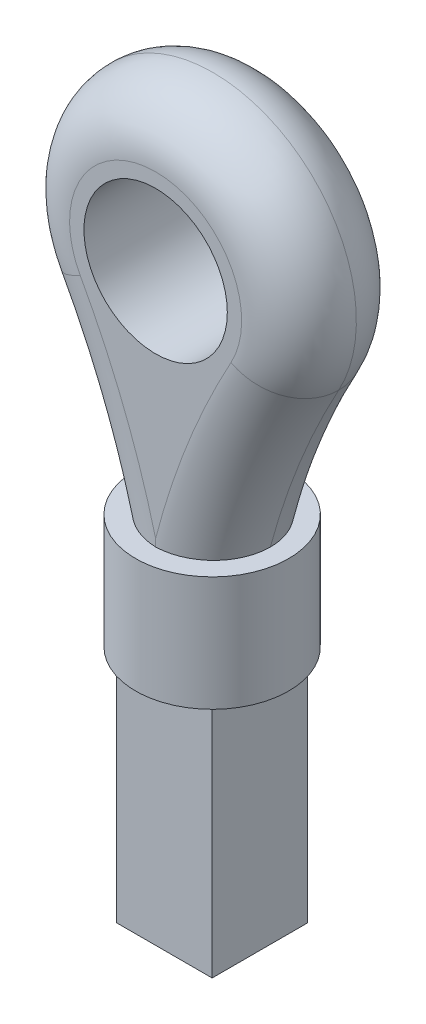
ISO-10303-21;
HEADER;
FILE_DESCRIPTION(('STEP AP214'),'2;1');
FILE_NAME('part.step','',(''),(''),'','','');
FILE_SCHEMA(('AUTOMOTIVE_DESIGN { 1 0 10303 214 1 1 1 1 }'));
ENDSEC;
DATA;
#1=APPLICATION_CONTEXT('core data for automotive mechanical design processes');
#2=APPLICATION_PROTOCOL_DEFINITION('international standard','automotive_design',2000,#1);
#3=PRODUCT_CONTEXT('',#1,'mechanical');
#4=PRODUCT('Part','Part','',(#3));
#5=PRODUCT_RELATED_PRODUCT_CATEGORY('part','',(#4));
#6=PRODUCT_DEFINITION_FORMATION('','',#4);
#7=PRODUCT_DEFINITION_CONTEXT('part definition',#1,'design');
#8=PRODUCT_DEFINITION('design','',#6,#7);
#9=PRODUCT_DEFINITION_SHAPE('','',#8);
#10=(LENGTH_UNIT() NAMED_UNIT(*) SI_UNIT(.MILLI.,.METRE.));
#11=(NAMED_UNIT(*) PLANE_ANGLE_UNIT() SI_UNIT($,.RADIAN.));
#12=(NAMED_UNIT(*) SI_UNIT($,.STERADIAN.) SOLID_ANGLE_UNIT());
#13=UNCERTAINTY_MEASURE_WITH_UNIT(LENGTH_MEASURE(1.E-05),#10,'distance_accuracy_value','');
#14=(GEOMETRIC_REPRESENTATION_CONTEXT(3) GLOBAL_UNCERTAINTY_ASSIGNED_CONTEXT((#13)) GLOBAL_UNIT_ASSIGNED_CONTEXT((#10,
#11,#12)) REPRESENTATION_CONTEXT('',''));
#15=CARTESIAN_POINT('',(0.,0.,0.));
#16=DIRECTION('',(0.,0.,1.));
#17=DIRECTION('',(1.,0.,0.));
#18=AXIS2_PLACEMENT_3D('',#15,#16,#17);
#19=CARTESIAN_POINT('',(0.,-37.,6.08685653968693));
#20=DIRECTION('',(0.,-1.,0.));
#21=DIRECTION('',(0.,0.,-1.));
#22=AXIS2_PLACEMENT_3D('',#19,#20,#21);
#23=PLANE('',#22);
#24=CARTESIAN_POINT('',(0.,-37.,6.08685653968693));
#25=DIRECTION('',(0.,-1.,0.));
#26=DIRECTION('',(0.,0.,-1.));
#27=AXIS2_PLACEMENT_3D('',#24,#25,#26);
#28=CIRCLE('',#27,8.00777729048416);
#29=CARTESIAN_POINT('',(0.,-37.,-1.92092075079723));
#30=VERTEX_POINT('',#29);
#31=EDGE_CURVE('E206',#30,#30,#28,.T.);
#32=ORIENTED_EDGE('',*,*,#31,.T.);
#33=EDGE_LOOP('',(#32));
#34=FACE_BOUND('',#33,.T.);
#35=DIRECTION('',(-1.,0.,0.));
#36=VECTOR('',#35,1.);
#37=CARTESIAN_POINT('',(-5.,-37.,11.0868565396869));
#38=LINE('',#37,#36);
#39=CARTESIAN_POINT('',(5.,-37.,11.0868565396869));
#40=VERTEX_POINT('',#39);
#41=CARTESIAN_POINT('',(-5.,-37.,11.0868565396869));
#42=VERTEX_POINT('',#41);
#43=EDGE_CURVE('E282',#40,#42,#38,.T.);
#44=ORIENTED_EDGE('',*,*,#43,.F.);
#45=DIRECTION('',(0.,0.,1.));
#46=VECTOR('',#45,1.);
#47=CARTESIAN_POINT('',(5.,-37.,11.0868565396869));
#48=LINE('',#47,#46);
#49=CARTESIAN_POINT('',(5.,-37.,1.08685653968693));
#50=VERTEX_POINT('',#49);
#51=EDGE_CURVE('E284',#50,#40,#48,.T.);
#52=ORIENTED_EDGE('',*,*,#51,.F.);
#53=DIRECTION('',(1.,0.,0.));
#54=VECTOR('',#53,1.);
#55=CARTESIAN_POINT('',(-5.,-37.,1.08685653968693));
#56=LINE('',#55,#54);
#57=CARTESIAN_POINT('',(-5.,-37.,1.08685653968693));
#58=VERTEX_POINT('',#57);
#59=EDGE_CURVE('E277',#58,#50,#56,.T.);
#60=ORIENTED_EDGE('',*,*,#59,.F.);
#61=DIRECTION('',(0.,0.,-1.));
#62=VECTOR('',#61,1.);
#63=CARTESIAN_POINT('',(-5.,-37.,11.0868565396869));
#64=LINE('',#63,#62);
#65=EDGE_CURVE('E280',#42,#58,#64,.T.);
#66=ORIENTED_EDGE('',*,*,#65,.F.);
#67=EDGE_LOOP('',(#44,#52,#60,#66));
#68=FACE_BOUND('',#67,.T.);
#69=ADVANCED_FACE('F37',(#34,#68),#23,.T.);
#70=CARTESIAN_POINT('',(-83.2658403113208,-45.736198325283,12.));
#71=DIRECTION('',(0.,0.,-1.));
#72=DIRECTION('',(-1.,0.,0.));
#73=AXIS2_PLACEMENT_3D('',#70,#71,#72);
#74=PLANE('',#73);
#75=CARTESIAN_POINT('',(0.,0.,12.));
#76=DIRECTION('',(0.,0.,-1.));
#77=DIRECTION('',(-1.,0.,0.));
#78=AXIS2_PLACEMENT_3D('',#75,#76,#77);
#79=CIRCLE('',#78,9.00000000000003);
#80=CARTESIAN_POINT('',(7.88834276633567,-4.33290299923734,12.));
#81=VERTEX_POINT('',#80);
#82=CARTESIAN_POINT('',(-7.88834276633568,-4.33290299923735,12.));
#83=VERTEX_POINT('',#82);
#84=EDGE_CURVE('E46',#81,#83,#79,.F.);
#85=ORIENTED_EDGE('',*,*,#84,.T.);
#86=CARTESIAN_POINT('',(-83.2658403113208,-45.736198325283,12.));
#87=DIRECTION('',(0.,0.,-1.));
#88=DIRECTION('',(-1.,0.,0.));
#89=AXIS2_PLACEMENT_3D('',#86,#87,#88);
#90=CIRCLE('',#89,86.);
#91=CARTESIAN_POINT('',(0.,-24.2234152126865,12.));
#92=VERTEX_POINT('',#91);
#93=EDGE_CURVE('E11',#83,#92,#90,.T.);
#94=ORIENTED_EDGE('',*,*,#93,.T.);
#95=CARTESIAN_POINT('',(83.2658403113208,-45.736198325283,12.));
#96=DIRECTION('',(0.,0.,-1.));
#97=DIRECTION('',(-1.,0.,0.));
#98=AXIS2_PLACEMENT_3D('',#95,#96,#97);
#99=CIRCLE('',#98,86.);
#100=EDGE_CURVE('E113',#92,#81,#99,.T.);
#101=ORIENTED_EDGE('',*,*,#100,.T.);
#102=EDGE_LOOP('',(#85,#94,#101));
#103=FACE_BOUND('',#102,.T.);
#104=CARTESIAN_POINT('',(0.,0.,12.));
#105=DIRECTION('',(0.,0.,1.));
#106=DIRECTION('',(1.,0.,0.));
#107=AXIS2_PLACEMENT_3D('',#104,#105,#106);
#108=CIRCLE('',#107,7.5);
#109=CARTESIAN_POINT('',(7.5,0.,12.));
#110=VERTEX_POINT('',#109);
#111=EDGE_CURVE('E124',#110,#110,#108,.T.);
#112=ORIENTED_EDGE('',*,*,#111,.F.);
#113=EDGE_LOOP('',(#112));
#114=FACE_BOUND('',#113,.T.);
#115=ADVANCED_FACE('F117',(#103,#114),#74,.F.);
#116=CARTESIAN_POINT('',(-83.2658403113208,-45.736198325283,0.));
#117=DIRECTION('',(0.,0.,-1.));
#118=DIRECTION('',(-1.,0.,0.));
#119=AXIS2_PLACEMENT_3D('',#116,#117,#118);
#120=PLANE('',#119);
#121=CARTESIAN_POINT('',(83.2658403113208,-45.736198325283,0.));
#122=DIRECTION('',(0.,0.,-1.));
#123=DIRECTION('',(-1.,0.,0.));
#124=AXIS2_PLACEMENT_3D('',#121,#122,#123);
#125=CIRCLE('',#124,86.);
#126=CARTESIAN_POINT('',(7.88834276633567,-4.33290299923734,0.));
#127=VERTEX_POINT('',#126);
#128=CARTESIAN_POINT('',(0.,-24.2234152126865,0.));
#129=VERTEX_POINT('',#128);
#130=EDGE_CURVE('E195',#127,#129,#125,.F.);
#131=ORIENTED_EDGE('',*,*,#130,.T.);
#132=CARTESIAN_POINT('',(-83.2658403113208,-45.736198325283,0.));
#133=DIRECTION('',(0.,0.,-1.));
#134=DIRECTION('',(-1.,0.,0.));
#135=AXIS2_PLACEMENT_3D('',#132,#133,#134);
#136=CIRCLE('',#135,86.);
#137=CARTESIAN_POINT('',(-7.88834276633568,-4.33290299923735,0.));
#138=VERTEX_POINT('',#137);
#139=EDGE_CURVE('E115',#129,#138,#136,.F.);
#140=ORIENTED_EDGE('',*,*,#139,.T.);
#141=CARTESIAN_POINT('',(0.,0.,0.));
#142=DIRECTION('',(0.,0.,-1.));
#143=DIRECTION('',(-1.,0.,0.));
#144=AXIS2_PLACEMENT_3D('',#141,#142,#143);
#145=CIRCLE('',#144,9.00000000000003);
#146=EDGE_CURVE('E249',#138,#127,#145,.T.);
#147=ORIENTED_EDGE('',*,*,#146,.T.);
#148=EDGE_LOOP('',(#131,#140,#147));
#149=FACE_BOUND('',#148,.T.);
#150=CARTESIAN_POINT('',(0.,0.,0.));
#151=DIRECTION('',(0.,0.,1.));
#152=DIRECTION('',(1.,0.,0.));
#153=AXIS2_PLACEMENT_3D('',#150,#151,#152);
#154=CIRCLE('',#153,7.5);
#155=CARTESIAN_POINT('',(7.5,0.,0.));
#156=VERTEX_POINT('',#155);
#157=EDGE_CURVE('E126',#156,#156,#154,.T.);
#158=ORIENTED_EDGE('',*,*,#157,.T.);
#159=EDGE_LOOP('',(#158));
#160=FACE_BOUND('',#159,.T.);
#161=ADVANCED_FACE('F120',(#149,#160),#120,.T.);
#162=CARTESIAN_POINT('',(0.,0.,12.));
#163=DIRECTION('',(0.,0.,-1.));
#164=DIRECTION('',(-1.,0.,0.));
#165=AXIS2_PLACEMENT_3D('',#162,#163,#164);
#166=CYLINDRICAL_SURFACE('',#165,7.5);
#167=ORIENTED_EDGE('',*,*,#111,.T.);
#168=EDGE_LOOP('',(#167));
#169=FACE_BOUND('',#168,.T.);
#170=ORIENTED_EDGE('',*,*,#157,.F.);
#171=EDGE_LOOP('',(#170));
#172=FACE_BOUND('',#171,.T.);
#173=ADVANCED_FACE('F235',(#169,#172),#166,.F.);
#174=CARTESIAN_POINT('',(0.,0.,6.));
#175=DIRECTION('',(0.,0.,-1.));
#176=DIRECTION('',(-1.,0.,0.));
#177=AXIS2_PLACEMENT_3D('',#174,#175,#176);
#178=TOROIDAL_SURFACE('',#177,9.00000000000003,6.);
#179=CARTESIAN_POINT('',(-7.88834276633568,-4.33290299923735,6.));
#180=DIRECTION('',(0.481433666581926,-0.876482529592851,0.));
#181=DIRECTION('',(0.876482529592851,0.481433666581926,0.));
#182=AXIS2_PLACEMENT_3D('',#179,#180,#181);
#183=CIRCLE('',#182,6.);
#184=CARTESIAN_POINT('',(-13.1472379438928,-7.2215049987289,6.));
#185=VERTEX_POINT('',#184);
#186=EDGE_CURVE('E110',#83,#185,#183,.T.);
#187=ORIENTED_EDGE('',*,*,#186,.F.);
#188=ORIENTED_EDGE('',*,*,#84,.F.);
#189=CARTESIAN_POINT('',(7.88834276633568,-4.33290299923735,6.));
#190=DIRECTION('',(-0.481433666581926,-0.876482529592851,0.));
#191=DIRECTION('',(0.876482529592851,-0.481433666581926,0.));
#192=AXIS2_PLACEMENT_3D('',#189,#190,#191);
#193=CIRCLE('',#192,6.);
#194=CARTESIAN_POINT('',(13.1472379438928,-7.2215049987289,6.));
#195=VERTEX_POINT('',#194);
#196=EDGE_CURVE('E41',#195,#81,#193,.T.);
#197=ORIENTED_EDGE('',*,*,#196,.F.);
#198=CARTESIAN_POINT('',(0.,0.,6.));
#199=DIRECTION('',(0.,0.,-1.));
#200=DIRECTION('',(-1.,0.,0.));
#201=AXIS2_PLACEMENT_3D('',#198,#199,#200);
#202=CIRCLE('',#201,15.);
#203=EDGE_CURVE('E181',#185,#195,#202,.T.);
#204=ORIENTED_EDGE('',*,*,#203,.F.);
#205=EDGE_LOOP('',(#187,#188,#197,#204));
#206=FACE_BOUND('',#205,.T.);
#207=ADVANCED_FACE('F39',(#206),#178,.T.);
#208=CARTESIAN_POINT('',(83.2658403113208,-45.736198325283,6.));
#209=DIRECTION('',(0.,0.,-1.));
#210=DIRECTION('',(-1.,0.,0.));
#211=AXIS2_PLACEMENT_3D('',#208,#209,#210);
#212=TOROIDAL_SURFACE('',#211,86.,6.);
#213=ORIENTED_EDGE('',*,*,#196,.T.);
#214=ORIENTED_EDGE('',*,*,#100,.F.);
#215=CARTESIAN_POINT('',(0.,-24.2234152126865,12.));
#216=CARTESIAN_POINT('',(0.,-24.2234152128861,12.));
#217=CARTESIAN_POINT('',(0.,-24.2234152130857,12.));
#218=CARTESIAN_POINT('',(0.,-24.2308349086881,12.));
#219=CARTESIAN_POINT('',(0.,-24.2382546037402,11.9999991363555));
#220=CARTESIAN_POINT('',(0.,-25.2460721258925,11.9997658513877));
#221=CARTESIAN_POINT('',(0.,-26.2464799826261,11.9840123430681));
#222=CARTESIAN_POINT('',(0.,-28.2467892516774,11.9326222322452));
#223=CARTESIAN_POINT('',(0.,-29.2466905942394,11.8969833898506));
#224=CARTESIAN_POINT('',(0.,-31.2464519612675,11.8154396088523));
#225=CARTESIAN_POINT('',(0.,-32.2463118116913,11.769530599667));
#226=CARTESIAN_POINT('',(0.,-34.245927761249,11.6761034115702));
#227=CARTESIAN_POINT('',(0.,-35.2456838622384,11.6285852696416));
#228=CARTESIAN_POINT('',(0.,-36.8900450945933,11.5553754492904));
#229=CARTESIAN_POINT('',(0.,-37.5345694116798,11.5279293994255));
#230=CARTESIAN_POINT('',(0.,-38.8237868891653,11.4772788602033));
#231=CARTESIAN_POINT('',(0.,-39.4684800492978,11.4540743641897));
#232=CARTESIAN_POINT('',(0.,-40.7580264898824,11.4133879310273));
#233=CARTESIAN_POINT('',(0.,-41.4028797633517,11.3959057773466));
#234=CARTESIAN_POINT('',(0.,-42.6927376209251,11.3677738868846));
#235=CARTESIAN_POINT('',(0.,-43.33774220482,11.357124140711));
#236=CARTESIAN_POINT('',(0.,-44.6276776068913,11.3433397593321));
#237=CARTESIAN_POINT('',(0.,-45.2726084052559,11.3402033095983));
#238=CARTESIAN_POINT('',(0.,-46.5624613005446,11.3416411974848));
#239=CARTESIAN_POINT('',(0.,-47.2073833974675,11.3462155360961));
#240=CARTESIAN_POINT('',(0.,-48.4971371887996,11.3627819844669));
#241=CARTESIAN_POINT('',(0.,-49.141968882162,11.3747741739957));
#242=CARTESIAN_POINT('',(0.,-50.431471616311,11.4054108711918));
#243=CARTESIAN_POINT('',(0.,-51.0761426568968,11.4240553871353));
#244=CARTESIAN_POINT('',(0.,-52.3669663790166,11.4668671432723));
#245=CARTESIAN_POINT('',(0.,-53.0131185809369,11.4910485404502));
#246=CARTESIAN_POINT('',(0.,-54.3052610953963,11.5433609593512));
#247=CARTESIAN_POINT('',(0.,-54.9512514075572,11.5714919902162));
#248=CARTESIAN_POINT('',(0.,-56.2431928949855,11.6298803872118));
#249=CARTESIAN_POINT('',(0.,-56.889144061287,11.6601379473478));
#250=CARTESIAN_POINT('',(0.,-58.1810471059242,11.7207321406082));
#251=CARTESIAN_POINT('',(0.,-58.826998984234,11.7510687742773));
#252=CARTESIAN_POINT('',(0.,-60.1188569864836,11.8095897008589));
#253=CARTESIAN_POINT('',(0.,-60.7647630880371,11.8377744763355));
#254=CARTESIAN_POINT('',(0.,-62.056754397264,11.8896100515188));
#255=CARTESIAN_POINT('',(0.,-62.7028396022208,11.9132609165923));
#256=CARTESIAN_POINT('',(0.,-63.9951390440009,11.9534561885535));
#257=CARTESIAN_POINT('',(0.,-64.6413532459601,11.9700016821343));
#258=CARTESIAN_POINT('',(0.,-65.933954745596,11.9931972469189));
#259=CARTESIAN_POINT('',(0.,-66.5803420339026,11.9998477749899));
#260=CARTESIAN_POINT('',(0.,-67.2341420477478,11.9999991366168));
#261=CARTESIAN_POINT('',(0.,-67.2415617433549,11.9999999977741));
#262=CARTESIAN_POINT('',(0.,-67.2489814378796,12.));
#263=B_SPLINE_CURVE_WITH_KNOTS('',3,(#215,#216,#217,#218,#219,#220,#221,#222,#223,#224,#225,
#226,#227,#228,#229,#230,#231,#232,#233,#234,#235,#236,#237,#238,#239,#240,#241,#242,#243,#244,
#245,#246,#247,#248,#249,#250,#251,#252,#253,#254,#255,#256,#257,#258,#259,#260,#261,#262),
.UNSPECIFIED.,.F.,.F.,(4,2,2,2,2,2,2,2,2,2,2,2,2,2,2,2,2,2,2,2,2,2,2,4),(0.,
5.98895932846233E-10,0.0222590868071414,3.023452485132,6.02498400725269,9.027707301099,
12.0303616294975,13.9656773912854,15.9009901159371,17.8362296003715,19.7714664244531,
21.7062358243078,23.6410054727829,25.5757959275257,27.5105887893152,29.4503849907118,
31.3901856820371,33.3301635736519,35.2701548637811,37.2097098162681,39.1492368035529,
41.0884670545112,43.0276077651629,43.0498668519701),.UNSPECIFIED.);
#264=CARTESIAN_POINT('',(0.,-25.,11.996960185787));
#265=VERTEX_POINT('',#264);
#266=EDGE_CURVE('E104',#265,#92,#263,.F.);
#267=ORIENTED_EDGE('',*,*,#266,.F.);
#268=CARTESIAN_POINT('',(6.,-25.,6.));
#269=CARTESIAN_POINT('',(6.00002201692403,-25.,6.16466926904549));
#270=CARTESIAN_POINT('',(5.99298208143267,-25.,6.32933364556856));
#271=CARTESIAN_POINT('',(5.96493877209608,-25.,6.65744971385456));
#272=CARTESIAN_POINT('',(5.94393709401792,-25.,6.82090155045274));
#273=CARTESIAN_POINT('',(5.88817783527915,-25.,7.14515606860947));
#274=CARTESIAN_POINT('',(5.85344355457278,-25.,7.3059627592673));
#275=CARTESIAN_POINT('',(5.77052586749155,-25.,7.62406897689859));
#276=CARTESIAN_POINT('',(5.72234243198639,-25.,7.78136849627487));
#277=CARTESIAN_POINT('',(5.61293958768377,-25.,8.09134799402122));
#278=CARTESIAN_POINT('',(5.55172140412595,-25.,8.24402840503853));
#279=CARTESIAN_POINT('',(5.41673123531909,-25.,8.54379993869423));
#280=CARTESIAN_POINT('',(5.34295461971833,-25.,8.69088897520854));
#281=CARTESIAN_POINT('',(5.18348635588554,-25.,8.97839679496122));
#282=CARTESIAN_POINT('',(5.09779841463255,-25.,9.11881763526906));
#283=CARTESIAN_POINT('',(4.91513116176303,-25.,9.39218431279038));
#284=CARTESIAN_POINT('',(4.81814762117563,-25.,9.52512732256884));
#285=CARTESIAN_POINT('',(4.61212353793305,-25.,9.78458041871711));
#286=CARTESIAN_POINT('',(4.50292427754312,-25.,9.91096445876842));
#287=CARTESIAN_POINT('',(4.27447282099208,-25.,10.1543760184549));
#288=CARTESIAN_POINT('',(4.15521695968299,-25.,10.2714000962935));
#289=CARTESIAN_POINT('',(3.90758270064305,-25.,10.495319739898));
#290=CARTESIAN_POINT('',(3.77920562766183,-25.,10.6022167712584));
#291=CARTESIAN_POINT('',(3.51418079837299,-25.,10.8053144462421));
#292=CARTESIAN_POINT('',(3.37752996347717,-25.,10.9015110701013));
#293=CARTESIAN_POINT('',(3.09250680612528,-25.,11.0854802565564));
#294=CARTESIAN_POINT('',(2.94390052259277,-25.,11.1728904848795));
#295=CARTESIAN_POINT('',(2.63994737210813,-25.,11.3352089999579));
#296=CARTESIAN_POINT('',(2.48459815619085,-25.,11.410112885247));
#297=CARTESIAN_POINT('',(2.16830589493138,-25.,11.5469416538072));
#298=CARTESIAN_POINT('',(2.00736343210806,-25.,11.6088678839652));
#299=CARTESIAN_POINT('',(1.6809659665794,-25.,11.7193974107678));
#300=CARTESIAN_POINT('',(1.51551086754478,-25.,11.7680004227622));
#301=CARTESIAN_POINT('',(1.17656427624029,-25.,11.8527632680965));
#302=CARTESIAN_POINT('',(1.00297713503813,-25.,11.8885410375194));
#303=CARTESIAN_POINT('',(0.65348358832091,-25.,11.9455011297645));
#304=CARTESIAN_POINT('',(0.477577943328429,-25.,11.9666881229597));
#305=CARTESIAN_POINT('',(0.124532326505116,-25.,11.9943560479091));
#306=CARTESIAN_POINT('',(-0.0526081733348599,-25.,12.0008302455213));
#307=CARTESIAN_POINT('',(-0.406747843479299,-25.,11.998999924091));
#308=CARTESIAN_POINT('',(-0.583747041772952,-25.,11.9907008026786));
#309=CARTESIAN_POINT('',(-0.938504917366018,-25.,11.9591813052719));
#310=CARTESIAN_POINT('',(-1.11624820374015,-25.,11.9357872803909));
#311=CARTESIAN_POINT('',(-1.46905147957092,-25.,11.8740475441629));
#312=CARTESIAN_POINT('',(-1.64411244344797,-25.,11.8357074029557));
#313=CARTESIAN_POINT('',(-1.99039993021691,-25.,11.7442756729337));
#314=CARTESIAN_POINT('',(-2.16162522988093,-25.,11.6911794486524));
#315=CARTESIAN_POINT('',(-2.49884958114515,-25.,11.5705764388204));
#316=CARTESIAN_POINT('',(-2.6648506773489,-25.,11.5030753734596));
#317=CARTESIAN_POINT('',(-2.98909133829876,-25.,11.3546820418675));
#318=CARTESIAN_POINT('',(-3.14738388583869,-25.,11.2739055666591));
#319=CARTESIAN_POINT('',(-3.45640591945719,-25.,11.099110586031));
#320=CARTESIAN_POINT('',(-3.60713822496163,-25.,11.0050970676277));
#321=CARTESIAN_POINT('',(-3.90000517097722,-25.,10.8043618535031));
#322=CARTESIAN_POINT('',(-4.04213540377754,-25.,10.697633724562));
#323=CARTESIAN_POINT('',(-4.31657391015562,-25.,10.4722270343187));
#324=CARTESIAN_POINT('',(-4.44888271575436,-25.,10.3535491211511));
#325=CARTESIAN_POINT('',(-4.69976598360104,-25.,10.1078402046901));
#326=CARTESIAN_POINT('',(-4.81858120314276,-25.,9.98105497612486));
#327=CARTESIAN_POINT('',(-5.04483742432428,-25.,9.71771694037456));
#328=CARTESIAN_POINT('',(-5.15227904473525,-25.,9.5811646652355));
#329=CARTESIAN_POINT('',(-5.35474195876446,-25.,9.29948815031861));
#330=CARTESIAN_POINT('',(-5.44978334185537,-25.,9.15437834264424));
#331=CARTESIAN_POINT('',(-5.62681741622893,-25.,8.85648941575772));
#332=CARTESIAN_POINT('',(-5.70881752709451,-25.,8.70371472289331));
#333=CARTESIAN_POINT('',(-5.82392169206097,-25.,8.46468554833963));
#334=CARTESIAN_POINT('',(-5.86194672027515,-25.,8.38076748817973));
#335=CARTESIAN_POINT('',(-5.93398209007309,-25.,8.21137059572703));
#336=CARTESIAN_POINT('',(-5.96799822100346,-25.,8.12589422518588));
#337=CARTESIAN_POINT('',(-6.00000000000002,-25.,8.03965713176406));
#338=B_SPLINE_CURVE_WITH_KNOTS('',3,(#268,#269,#270,#271,#272,#273,#274,#275,#276,#277,#278,
#279,#280,#281,#282,#283,#284,#285,#286,#287,#288,#289,#290,#291,#292,#293,#294,#295,#296,#297,
#298,#299,#300,#301,#302,#303,#304,#305,#306,#307,#308,#309,#310,#311,#312,#313,#314,#315,#316,
#317,#318,#319,#320,#321,#322,#323,#324,#325,#326,#327,#328,#329,#330,#331,#332,#333,#334,#335,
#336,#337),.UNSPECIFIED.,.F.,.F.,(4,2,2,2,2,2,2,2,2,2,2,2,2,2,2,2,2,2,2,2,2,2,2,2,2,2,2,2,2,2,2,
2,2,2,4),(0.,0.49385005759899,0.987640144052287,1.48059599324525,1.97355291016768,
2.46646351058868,2.95955624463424,3.45249586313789,3.9456206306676,4.44612524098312,
4.94681305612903,5.44742830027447,5.94823097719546,6.46486163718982,6.9816737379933,
7.49843217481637,8.01520165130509,8.54628889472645,9.07720606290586,9.60836618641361,
10.1393322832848,10.6765181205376,11.2135039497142,11.7506586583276,12.28760045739,
12.8200858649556,13.3523711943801,13.8849269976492,14.4174539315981,14.9380866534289,
15.4586910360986,15.978441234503,16.4978946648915,16.7741993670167,17.0501000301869),.UNSPECIFIED.);
#339=CARTESIAN_POINT('',(6.,-25.,6.));
#340=VERTEX_POINT('',#339);
#341=EDGE_CURVE('E83',#340,#265,#338,.T.);
#342=ORIENTED_EDGE('',*,*,#341,.F.);
#343=CARTESIAN_POINT('',(83.2658403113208,-45.736198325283,6.));
#344=DIRECTION('',(0.,0.,-1.));
#345=DIRECTION('',(-1.,0.,0.));
#346=AXIS2_PLACEMENT_3D('',#343,#344,#345);
#347=CIRCLE('',#346,80.);
#348=EDGE_CURVE('E111',#195,#340,#347,.F.);
#349=ORIENTED_EDGE('',*,*,#348,.F.);
#350=EDGE_LOOP('',(#213,#214,#267,#342,#349));
#351=FACE_BOUND('',#350,.T.);
#352=ADVANCED_FACE('F114',(#351),#212,.T.);
#353=CARTESIAN_POINT('',(0.,0.,6.));
#354=DIRECTION('',(0.,0.,-1.));
#355=DIRECTION('',(-1.,0.,0.));
#356=AXIS2_PLACEMENT_3D('',#353,#354,#355);
#357=TOROIDAL_SURFACE('',#356,9.00000000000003,6.);
#358=CARTESIAN_POINT('',(-7.88834276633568,-4.33290299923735,6.));
#359=DIRECTION('',(0.481433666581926,-0.876482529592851,0.));
#360=DIRECTION('',(0.876482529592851,0.481433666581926,0.));
#361=AXIS2_PLACEMENT_3D('',#358,#359,#360);
#362=CIRCLE('',#361,6.);
#363=EDGE_CURVE('E189',#185,#138,#362,.T.);
#364=ORIENTED_EDGE('',*,*,#363,.F.);
#365=ORIENTED_EDGE('',*,*,#203,.T.);
#366=CARTESIAN_POINT('',(7.88834276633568,-4.33290299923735,6.));
#367=DIRECTION('',(-0.481433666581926,-0.876482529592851,0.));
#368=DIRECTION('',(0.876482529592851,-0.481433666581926,0.));
#369=AXIS2_PLACEMENT_3D('',#366,#367,#368);
#370=CIRCLE('',#369,6.);
#371=EDGE_CURVE('E187',#127,#195,#370,.T.);
#372=ORIENTED_EDGE('',*,*,#371,.F.);
#373=ORIENTED_EDGE('',*,*,#146,.F.);
#374=EDGE_LOOP('',(#364,#365,#372,#373));
#375=FACE_BOUND('',#374,.T.);
#376=ADVANCED_FACE('F172',(#375),#357,.T.);
#377=CARTESIAN_POINT('',(-83.2658403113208,-45.736198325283,6.));
#378=DIRECTION('',(0.,0.,-1.));
#379=DIRECTION('',(-1.,0.,0.));
#380=AXIS2_PLACEMENT_3D('',#377,#378,#379);
#381=TOROIDAL_SURFACE('',#380,86.,6.);
#382=ORIENTED_EDGE('',*,*,#93,.F.);
#383=ORIENTED_EDGE('',*,*,#186,.T.);
#384=CARTESIAN_POINT('',(-83.2658403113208,-45.736198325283,6.));
#385=DIRECTION('',(0.,0.,-1.));
#386=DIRECTION('',(-1.,0.,0.));
#387=AXIS2_PLACEMENT_3D('',#384,#385,#386);
#388=CIRCLE('',#387,80.);
#389=CARTESIAN_POINT('',(-6.,-25.,6.));
#390=VERTEX_POINT('',#389);
#391=EDGE_CURVE('E196',#390,#185,#388,.F.);
#392=ORIENTED_EDGE('',*,*,#391,.F.);
#393=CARTESIAN_POINT('',(6.,-25.,8.03965713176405));
#394=CARTESIAN_POINT('',(5.94130359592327,-25.,8.19788701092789));
#395=CARTESIAN_POINT('',(5.87578062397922,-25.,8.35357353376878));
#396=CARTESIAN_POINT('',(5.73171088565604,-25.,8.65876945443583));
#397=CARTESIAN_POINT('',(5.65316626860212,-25.,8.80827986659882));
#398=CARTESIAN_POINT('',(5.48380860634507,-25.,9.09983505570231));
#399=CARTESIAN_POINT('',(5.39301689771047,-25.,9.24189223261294));
#400=CARTESIAN_POINT('',(5.1997858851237,-25.,9.51785134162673));
#401=CARTESIAN_POINT('',(5.09734638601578,-25.,9.65175313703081));
#402=CARTESIAN_POINT('',(4.8816482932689,-25.,9.91046578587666));
#403=CARTESIAN_POINT('',(4.7683930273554,-25.,10.0352794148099));
#404=CARTESIAN_POINT('',(4.53185297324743,-25.,10.2750976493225));
#405=CARTESIAN_POINT('',(4.40856450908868,-25.,10.390098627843));
#406=CARTESIAN_POINT('',(4.15294032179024,-25.,10.6094898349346));
#407=CARTESIAN_POINT('',(4.02060689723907,-25.,10.7138827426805));
#408=CARTESIAN_POINT('',(3.74777164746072,-25.,10.9114927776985));
#409=CARTESIAN_POINT('',(3.60726677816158,-25.,11.0047057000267));
#410=CARTESIAN_POINT('',(3.31652680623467,-25.,11.180936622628));
#411=CARTESIAN_POINT('',(3.16616198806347,-25.,11.2637406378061));
#412=CARTESIAN_POINT('',(2.85906065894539,-25.,11.4166895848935));
#413=CARTESIAN_POINT('',(2.70232182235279,-25.,11.4868298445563));
#414=CARTESIAN_POINT('',(2.38364792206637,-25.,11.614003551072));
#415=CARTESIAN_POINT('',(2.22171377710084,-25.,11.6710393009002));
#416=CARTESIAN_POINT('',(1.89367311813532,-25.,11.7717250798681));
#417=CARTESIAN_POINT('',(1.72756507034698,-25.,11.8153701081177));
#418=CARTESIAN_POINT('',(1.38810942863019,-25.,11.8899473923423));
#419=CARTESIAN_POINT('',(1.21468499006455,-25.,11.9205301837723));
#420=CARTESIAN_POINT('',(0.865836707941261,-25.,11.96719850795));
#421=CARTESIAN_POINT('',(0.690412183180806,-25.,11.9832789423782));
#422=CARTESIAN_POINT('',(0.33885543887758,-25.,12.0008481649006));
#423=CARTESIAN_POINT('',(0.162723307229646,-25.,12.0023387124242));
#424=CARTESIAN_POINT('',(-0.189060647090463,-25.,11.9907405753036));
#425=CARTESIAN_POINT('',(-0.364712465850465,-25.,11.9776517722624));
#426=CARTESIAN_POINT('',(-0.717146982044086,-25.,11.9366560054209));
#427=CARTESIAN_POINT('',(-0.893902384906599,-25.,11.9085139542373));
#428=CARTESIAN_POINT('',(-1.24435624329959,-25.,11.8374599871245));
#429=CARTESIAN_POINT('',(-1.41805572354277,-25.,11.794553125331));
#430=CARTESIAN_POINT('',(-1.76128919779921,-25.,11.6942109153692));
#431=CARTESIAN_POINT('',(-1.93082137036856,-25.,11.6367693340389));
#432=CARTESIAN_POINT('',(-2.26434302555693,-25.,11.5077450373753));
#433=CARTESIAN_POINT('',(-2.428334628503,-25.,11.4361678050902));
#434=CARTESIAN_POINT('',(-2.74934204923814,-25.,11.27944015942));
#435=CARTESIAN_POINT('',(-2.90636967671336,-25.,11.19431394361));
#436=CARTESIAN_POINT('',(-3.21250459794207,-25.,11.0109684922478));
#437=CARTESIAN_POINT('',(-3.36161500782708,-25.,10.9127544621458));
#438=CARTESIAN_POINT('',(-3.65085569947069,-25.,10.7038111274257));
#439=CARTESIAN_POINT('',(-3.79098365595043,-25.,10.5930786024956));
#440=CARTESIAN_POINT('',(-4.06103167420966,-25.,10.3598983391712));
#441=CARTESIAN_POINT('',(-4.19095597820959,-25.,10.2374555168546));
#442=CARTESIAN_POINT('',(-4.4368766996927,-25.,9.9844311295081));
#443=CARTESIAN_POINT('',(-4.5531141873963,-25.,9.85408385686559));
#444=CARTESIAN_POINT('',(-4.77384006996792,-25.,9.58387462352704));
#445=CARTESIAN_POINT('',(-4.87833309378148,-25.,9.44401644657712));
#446=CARTESIAN_POINT('',(-5.07477504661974,-25.,9.1556495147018));
#447=CARTESIAN_POINT('',(-5.16671791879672,-25.,9.00713663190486));
#448=CARTESIAN_POINT('',(-5.33718148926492,-25.,8.70260406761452));
#449=CARTESIAN_POINT('',(-5.41570303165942,-25.,8.54658485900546));
#450=CARTESIAN_POINT('',(-5.55632825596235,-25.,8.23329186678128));
#451=CARTESIAN_POINT('',(-5.61887632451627,-25.,8.07621742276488));
#452=CARTESIAN_POINT('',(-5.7301768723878,-25.,7.75725854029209));
#453=CARTESIAN_POINT('',(-5.77893014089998,-25.,7.59537437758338));
#454=CARTESIAN_POINT('',(-5.86213261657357,-25.,7.26828158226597));
#455=CARTESIAN_POINT('',(-5.89660694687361,-25.,7.10307932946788));
#456=CARTESIAN_POINT('',(-5.95104607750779,-25.,6.77037478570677));
#457=CARTESIAN_POINT('',(-5.971019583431,-25.,6.60287393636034));
#458=CARTESIAN_POINT('',(-5.98910925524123,-25.,6.36247504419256));
#459=CARTESIAN_POINT('',(-5.99319554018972,-25.,6.28998540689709));
#460=CARTESIAN_POINT('',(-5.99863895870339,-25.,6.14500016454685));
#461=CARTESIAN_POINT('',(-5.99999971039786,-25.,6.07250469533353));
#462=CARTESIAN_POINT('',(-6.00000000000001,-25.,6.));
#463=B_SPLINE_CURVE_WITH_KNOTS('',3,(#393,#394,#395,#396,#397,#398,#399,#400,#401,#402,#403,
#404,#405,#406,#407,#408,#409,#410,#411,#412,#413,#414,#415,#416,#417,#418,#419,#420,#421,#422,
#423,#424,#425,#426,#427,#428,#429,#430,#431,#432,#433,#434,#435,#436,#437,#438,#439,#440,#441,
#442,#443,#444,#445,#446,#447,#448,#449,#450,#451,#452,#453,#454,#455,#456,#457,#458,#459,#460,
#461,#462),.UNSPECIFIED.,.F.,.F.,(4,2,2,2,2,2,2,2,2,2,2,2,2,2,2,2,2,2,2,2,2,2,2,2,2,2,2,2,2,2,2,
2,2,2,4),(0.,0.506127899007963,1.01217234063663,1.51734628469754,2.02252869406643,
2.52755616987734,3.0327695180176,3.53785495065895,4.0431297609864,4.55750978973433,
5.07207921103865,5.58655813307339,6.10122895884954,6.62891732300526,7.15679112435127,
7.68460126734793,8.21241569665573,8.74872455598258,9.28485001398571,9.82120577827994,
10.3573539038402,10.8925550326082,11.4275439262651,11.9626707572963,12.4975739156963,
13.0208686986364,13.5439565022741,14.0672958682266,14.590602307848,15.0971895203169,
15.603747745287,16.1094108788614,16.6147701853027,16.8325423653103,17.0500252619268),.UNSPECIFIED.);
#464=EDGE_CURVE('E109',#265,#390,#463,.T.);
#465=ORIENTED_EDGE('',*,*,#464,.F.);
#466=ORIENTED_EDGE('',*,*,#266,.T.);
#467=EDGE_LOOP('',(#382,#383,#392,#465,#466));
#468=FACE_BOUND('',#467,.T.);
#469=ADVANCED_FACE('F106',(#468),#381,.T.);
#470=CARTESIAN_POINT('',(83.2658403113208,-45.736198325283,6.));
#471=DIRECTION('',(0.,0.,-1.));
#472=DIRECTION('',(-1.,0.,0.));
#473=AXIS2_PLACEMENT_3D('',#470,#471,#472);
#474=TOROIDAL_SURFACE('',#473,86.,6.);
#475=ORIENTED_EDGE('',*,*,#348,.T.);
#476=CARTESIAN_POINT('',(-6.,-25.,3.96034286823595));
#477=CARTESIAN_POINT('',(-5.94130359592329,-25.,3.8021129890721));
#478=CARTESIAN_POINT('',(-5.87578062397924,-25.,3.64642646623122));
#479=CARTESIAN_POINT('',(-5.73171088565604,-25.,3.34123054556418));
#480=CARTESIAN_POINT('',(-5.65316626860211,-25.,3.19172013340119));
#481=CARTESIAN_POINT('',(-5.48380860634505,-25.,2.9001649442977));
#482=CARTESIAN_POINT('',(-5.39301689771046,-25.,2.75810776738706));
#483=CARTESIAN_POINT('',(-5.1997858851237,-25.,2.48214865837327));
#484=CARTESIAN_POINT('',(-5.09734638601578,-25.,2.34824686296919));
#485=CARTESIAN_POINT('',(-4.88164829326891,-25.,2.08953421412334));
#486=CARTESIAN_POINT('',(-4.7683930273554,-25.,1.9647205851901));
#487=CARTESIAN_POINT('',(-4.53185297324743,-25.,1.72490235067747));
#488=CARTESIAN_POINT('',(-4.40856450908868,-25.,1.609901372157));
#489=CARTESIAN_POINT('',(-4.15294032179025,-25.,1.39051016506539));
#490=CARTESIAN_POINT('',(-4.02060689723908,-25.,1.28611725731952));
#491=CARTESIAN_POINT('',(-3.74777164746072,-25.,1.08850722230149));
#492=CARTESIAN_POINT('',(-3.60726677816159,-25.,0.995294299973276));
#493=CARTESIAN_POINT('',(-3.31652680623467,-25.,0.81906337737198));
#494=CARTESIAN_POINT('',(-3.16616198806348,-25.,0.736259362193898));
#495=CARTESIAN_POINT('',(-2.8590606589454,-25.,0.583310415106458));
#496=CARTESIAN_POINT('',(-2.70232182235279,-25.,0.513170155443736));
#497=CARTESIAN_POINT('',(-2.38364792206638,-25.,0.385996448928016));
#498=CARTESIAN_POINT('',(-2.22171377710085,-25.,0.328960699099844));
#499=CARTESIAN_POINT('',(-1.89367311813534,-25.,0.228274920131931));
#500=CARTESIAN_POINT('',(-1.727565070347,-25.,0.184629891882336));
#501=CARTESIAN_POINT('',(-1.38810942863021,-25.,0.110052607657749));
#502=CARTESIAN_POINT('',(-1.21468499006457,-25.,0.079469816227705));
#503=CARTESIAN_POINT('',(-0.865836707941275,-25.,0.0328014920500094));
#504=CARTESIAN_POINT('',(-0.69041218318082,-25.,0.016721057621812));
#505=CARTESIAN_POINT('',(-0.338855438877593,-25.,-0.000848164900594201));
#506=CARTESIAN_POINT('',(-0.162723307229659,-25.,-0.00233871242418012));
#507=CARTESIAN_POINT('',(0.189060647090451,-25.,0.00925942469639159));
#508=CARTESIAN_POINT('',(0.364712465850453,-25.,0.0223482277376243));
#509=CARTESIAN_POINT('',(0.717146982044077,-25.,0.0633439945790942));
#510=CARTESIAN_POINT('',(0.893902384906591,-25.,0.0914860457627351));
#511=CARTESIAN_POINT('',(1.24435624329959,-25.,0.162540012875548));
#512=CARTESIAN_POINT('',(1.41805572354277,-25.,0.205446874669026));
#513=CARTESIAN_POINT('',(1.76128919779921,-25.,0.305789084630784));
#514=CARTESIAN_POINT('',(1.93082137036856,-25.,0.363230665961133));
#515=CARTESIAN_POINT('',(2.26434302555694,-25.,0.492254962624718));
#516=CARTESIAN_POINT('',(2.42833462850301,-25.,0.563832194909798));
#517=CARTESIAN_POINT('',(2.74934204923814,-25.,0.720559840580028));
#518=CARTESIAN_POINT('',(2.90636967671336,-25.,0.805686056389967));
#519=CARTESIAN_POINT('',(3.21250459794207,-25.,0.98903150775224));
#520=CARTESIAN_POINT('',(3.36161500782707,-25.,1.0872455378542));
#521=CARTESIAN_POINT('',(3.65085569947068,-25.,1.29618887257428));
#522=CARTESIAN_POINT('',(3.79098365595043,-25.,1.4069213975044));
#523=CARTESIAN_POINT('',(4.06103167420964,-25.,1.64010166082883));
#524=CARTESIAN_POINT('',(4.19095597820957,-25.,1.76254448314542));
#525=CARTESIAN_POINT('',(4.43687669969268,-25.,2.0155688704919));
#526=CARTESIAN_POINT('',(4.5531141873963,-25.,2.1459161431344));
#527=CARTESIAN_POINT('',(4.77384006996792,-25.,2.41612537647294));
#528=CARTESIAN_POINT('',(4.87833309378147,-25.,2.55598355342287));
#529=CARTESIAN_POINT('',(5.07477504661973,-25.,2.84435048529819));
#530=CARTESIAN_POINT('',(5.16671791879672,-25.,2.99286336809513));
#531=CARTESIAN_POINT('',(5.33718148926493,-25.,3.29739593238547));
#532=CARTESIAN_POINT('',(5.41570303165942,-25.,3.45341514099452));
#533=CARTESIAN_POINT('',(5.55632825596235,-25.,3.76670813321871));
#534=CARTESIAN_POINT('',(5.61887632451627,-25.,3.92378257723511));
#535=CARTESIAN_POINT('',(5.7301768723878,-25.,4.24274145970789));
#536=CARTESIAN_POINT('',(5.77893014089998,-25.,4.4046256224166));
#537=CARTESIAN_POINT('',(5.86213261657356,-25.,4.73171841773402));
#538=CARTESIAN_POINT('',(5.8966069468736,-25.,4.89692067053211));
#539=CARTESIAN_POINT('',(5.95104607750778,-25.,5.22962521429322));
#540=CARTESIAN_POINT('',(5.97101958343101,-25.,5.39712606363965));
#541=CARTESIAN_POINT('',(5.98910925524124,-25.,5.63752495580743));
#542=CARTESIAN_POINT('',(5.99319554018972,-25.,5.7100145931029));
#543=CARTESIAN_POINT('',(5.99863895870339,-25.,5.85499983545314));
#544=CARTESIAN_POINT('',(5.99999971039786,-25.,5.92749530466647));
#545=CARTESIAN_POINT('',(6.00000000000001,-25.,6.));
#546=B_SPLINE_CURVE_WITH_KNOTS('',3,(#476,#477,#478,#479,#480,#481,#482,#483,#484,#485,#486,
#487,#488,#489,#490,#491,#492,#493,#494,#495,#496,#497,#498,#499,#500,#501,#502,#503,#504,#505,
#506,#507,#508,#509,#510,#511,#512,#513,#514,#515,#516,#517,#518,#519,#520,#521,#522,#523,#524,
#525,#526,#527,#528,#529,#530,#531,#532,#533,#534,#535,#536,#537,#538,#539,#540,#541,#542,#543,
#544,#545),.UNSPECIFIED.,.F.,.F.,(4,2,2,2,2,2,2,2,2,2,2,2,2,2,2,2,2,2,2,2,2,2,2,2,2,2,2,2,2,2,2,
2,2,2,4),(0.,0.50612789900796,1.01217234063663,1.51734628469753,2.02252869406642,
2.52755616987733,3.03276951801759,3.53785495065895,4.0431297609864,4.55750978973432,
5.07207921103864,5.58655813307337,6.10122895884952,6.62891732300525,7.15679112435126,
7.68460126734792,8.21241569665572,8.74872455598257,9.28485001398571,9.82120577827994,
10.3573539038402,10.8925550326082,11.4275439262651,11.9626707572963,12.4975739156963,
13.0208686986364,13.5439565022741,14.0672958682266,14.590602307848,15.0971895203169,
15.603747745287,16.1094108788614,16.6147701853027,16.8325423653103,17.0500252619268),.UNSPECIFIED.);
#547=CARTESIAN_POINT('',(0.,-25.,0.00303981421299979));
#548=VERTEX_POINT('',#547);
#549=EDGE_CURVE('E128',#548,#340,#546,.T.);
#550=ORIENTED_EDGE('',*,*,#549,.F.);
#551=CARTESIAN_POINT('',(0.,-24.2234152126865,0.));
#552=CARTESIAN_POINT('',(0.,-24.2234152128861,0.));
#553=CARTESIAN_POINT('',(0.,-24.2234152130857,0.));
#554=CARTESIAN_POINT('',(0.,-24.2308349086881,0.));
#555=CARTESIAN_POINT('',(0.,-24.2382546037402,8.63644492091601E-07));
#556=CARTESIAN_POINT('',(0.,-25.2460721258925,0.000234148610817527));
#557=CARTESIAN_POINT('',(0.,-26.246479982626,0.0159876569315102));
#558=CARTESIAN_POINT('',(0.,-28.2467892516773,0.0673777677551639));
#559=CARTESIAN_POINT('',(0.,-29.2466905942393,0.103016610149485));
#560=CARTESIAN_POINT('',(0.,-31.2464519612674,0.184560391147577));
#561=CARTESIAN_POINT('',(0.,-32.2463118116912,0.230469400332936));
#562=CARTESIAN_POINT('',(0.,-34.245927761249,0.323896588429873));
#563=CARTESIAN_POINT('',(0.,-35.2456838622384,0.371414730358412));
#564=CARTESIAN_POINT('',(0.,-36.8900450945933,0.444624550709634));
#565=CARTESIAN_POINT('',(0.,-37.5345694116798,0.472070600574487));
#566=CARTESIAN_POINT('',(0.,-38.8237868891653,0.522721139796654));
#567=CARTESIAN_POINT('',(0.,-39.4684800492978,0.545925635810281));
#568=CARTESIAN_POINT('',(0.,-40.7580264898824,0.586612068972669));
#569=CARTESIAN_POINT('',(0.,-41.4028797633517,0.604094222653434));
#570=CARTESIAN_POINT('',(0.,-42.6927376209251,0.632226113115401));
#571=CARTESIAN_POINT('',(0.,-43.3377422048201,0.642875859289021));
#572=CARTESIAN_POINT('',(0.,-44.6276776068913,0.656660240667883));
#573=CARTESIAN_POINT('',(0.,-45.2726084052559,0.659796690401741));
#574=CARTESIAN_POINT('',(0.,-46.5624613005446,0.658358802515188));
#575=CARTESIAN_POINT('',(0.,-47.2073833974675,0.653784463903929));
#576=CARTESIAN_POINT('',(0.,-48.4971371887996,0.637218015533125));
#577=CARTESIAN_POINT('',(0.,-49.141968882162,0.625225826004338));
#578=CARTESIAN_POINT('',(0.,-50.431471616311,0.594589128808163));
#579=CARTESIAN_POINT('',(0.,-51.0761426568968,0.575944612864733));
#580=CARTESIAN_POINT('',(0.,-52.3669663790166,0.533132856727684));
#581=CARTESIAN_POINT('',(0.,-53.0131185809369,0.508951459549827));
#582=CARTESIAN_POINT('',(0.,-54.3052610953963,0.45663904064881));
#583=CARTESIAN_POINT('',(0.,-54.9512514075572,0.428508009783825));
#584=CARTESIAN_POINT('',(0.,-56.2431928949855,0.370119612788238));
#585=CARTESIAN_POINT('',(0.,-56.889144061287,0.33986205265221));
#586=CARTESIAN_POINT('',(0.,-58.1810471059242,0.279267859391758));
#587=CARTESIAN_POINT('',(0.,-58.826998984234,0.248931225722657));
#588=CARTESIAN_POINT('',(0.,-60.1188569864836,0.190410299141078));
#589=CARTESIAN_POINT('',(0.,-60.7647630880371,0.162225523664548));
#590=CARTESIAN_POINT('',(0.,-62.056754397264,0.110389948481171));
#591=CARTESIAN_POINT('',(0.,-62.7028396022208,0.0867390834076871));
#592=CARTESIAN_POINT('',(0.,-63.9951390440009,0.046543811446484));
#593=CARTESIAN_POINT('',(0.,-64.6413532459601,0.0299983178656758));
#594=CARTESIAN_POINT('',(0.,-65.933954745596,0.00680275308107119));
#595=CARTESIAN_POINT('',(0.,-66.5803420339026,0.00015222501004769));
#596=CARTESIAN_POINT('',(0.,-67.2341420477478,8.63383197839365E-07));
#597=CARTESIAN_POINT('',(0.,-67.2415617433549,2.22593780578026E-09));
#598=CARTESIAN_POINT('',(0.,-67.2489814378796,0.));
#599=B_SPLINE_CURVE_WITH_KNOTS('',3,(#551,#552,#553,#554,#555,#556,#557,#558,#559,#560,#561,
#562,#563,#564,#565,#566,#567,#568,#569,#570,#571,#572,#573,#574,#575,#576,#577,#578,#579,#580,
#581,#582,#583,#584,#585,#586,#587,#588,#589,#590,#591,#592,#593,#594,#595,#596,#597,#598),
.UNSPECIFIED.,.F.,.F.,(4,2,2,2,2,2,2,2,2,2,2,2,2,2,2,2,2,2,2,2,2,2,2,4),(0.,
5.98895932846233E-10,0.0222590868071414,3.0234524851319,6.02498400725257,9.02770730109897,
12.0303616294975,13.9656773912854,15.9009901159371,17.8362296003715,19.7714664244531,
21.7062358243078,23.6410054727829,25.5757959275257,27.5105887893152,29.4503849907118,
31.3901856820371,33.3301635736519,35.2701548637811,37.2097098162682,39.1492368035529,
41.0884670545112,43.0276077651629,43.0498668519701),.UNSPECIFIED.);
#600=EDGE_CURVE('E200',#129,#548,#599,.T.);
#601=ORIENTED_EDGE('',*,*,#600,.F.);
#602=ORIENTED_EDGE('',*,*,#130,.F.);
#603=ORIENTED_EDGE('',*,*,#371,.T.);
#604=EDGE_LOOP('',(#475,#550,#601,#602,#603));
#605=FACE_BOUND('',#604,.T.);
#606=ADVANCED_FACE('F171',(#605),#474,.T.);
#607=CARTESIAN_POINT('',(-83.2658403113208,-45.736198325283,6.));
#608=DIRECTION('',(0.,0.,-1.));
#609=DIRECTION('',(-1.,0.,0.));
#610=AXIS2_PLACEMENT_3D('',#607,#608,#609);
#611=TOROIDAL_SURFACE('',#610,86.,6.);
#612=ORIENTED_EDGE('',*,*,#363,.T.);
#613=ORIENTED_EDGE('',*,*,#139,.F.);
#614=ORIENTED_EDGE('',*,*,#600,.T.);
#615=CARTESIAN_POINT('',(-6.,-25.,6.));
#616=CARTESIAN_POINT('',(-6.00002201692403,-25.,5.83533073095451));
#617=CARTESIAN_POINT('',(-5.99298208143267,-25.,5.67066635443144));
#618=CARTESIAN_POINT('',(-5.96493877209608,-25.,5.34255028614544));
#619=CARTESIAN_POINT('',(-5.94393709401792,-25.,5.17909844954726));
#620=CARTESIAN_POINT('',(-5.88817783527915,-25.,4.85484393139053));
#621=CARTESIAN_POINT('',(-5.85344355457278,-25.,4.6940372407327));
#622=CARTESIAN_POINT('',(-5.77052586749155,-25.,4.37593102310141));
#623=CARTESIAN_POINT('',(-5.72234243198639,-25.,4.21863150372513));
#624=CARTESIAN_POINT('',(-5.61293958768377,-25.,3.90865200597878));
#625=CARTESIAN_POINT('',(-5.55172140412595,-25.,3.75597159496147));
#626=CARTESIAN_POINT('',(-5.4167312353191,-25.,3.45620006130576));
#627=CARTESIAN_POINT('',(-5.34295461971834,-25.,3.30911102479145));
#628=CARTESIAN_POINT('',(-5.18348635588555,-25.,3.02160320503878));
#629=CARTESIAN_POINT('',(-5.09779841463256,-25.,2.88118236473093));
#630=CARTESIAN_POINT('',(-4.91513116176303,-25.,2.60781568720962));
#631=CARTESIAN_POINT('',(-4.81814762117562,-25.,2.47487267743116));
#632=CARTESIAN_POINT('',(-4.61212353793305,-25.,2.21541958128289));
#633=CARTESIAN_POINT('',(-4.50292427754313,-25.,2.08903554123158));
#634=CARTESIAN_POINT('',(-4.27447282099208,-25.,1.84562398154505));
#635=CARTESIAN_POINT('',(-4.15521695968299,-25.,1.72859990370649));
#636=CARTESIAN_POINT('',(-3.90758270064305,-25.,1.50468026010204));
#637=CARTESIAN_POINT('',(-3.77920562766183,-25.,1.39778322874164));
#638=CARTESIAN_POINT('',(-3.51418079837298,-25.,1.19468555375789));
#639=CARTESIAN_POINT('',(-3.37752996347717,-25.,1.09848892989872));
#640=CARTESIAN_POINT('',(-3.09250680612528,-25.,0.9145197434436));
#641=CARTESIAN_POINT('',(-2.94390052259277,-25.,0.827109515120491));
#642=CARTESIAN_POINT('',(-2.63994737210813,-25.,0.66479100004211));
#643=CARTESIAN_POINT('',(-2.48459815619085,-25.,0.58988711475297));
#644=CARTESIAN_POINT('',(-2.16830589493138,-25.,0.453058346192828));
#645=CARTESIAN_POINT('',(-2.00736343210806,-25.,0.39113211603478));
#646=CARTESIAN_POINT('',(-1.68096596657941,-25.,0.280602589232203));
#647=CARTESIAN_POINT('',(-1.51551086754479,-25.,0.231999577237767));
#648=CARTESIAN_POINT('',(-1.1765642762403,-25.,0.147236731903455));
#649=CARTESIAN_POINT('',(-1.00297713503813,-25.,0.111458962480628));
#650=CARTESIAN_POINT('',(-0.653483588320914,-25.,0.054498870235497));
#651=CARTESIAN_POINT('',(-0.477577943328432,-25.,0.0333118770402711));
#652=CARTESIAN_POINT('',(-0.124532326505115,-25.,0.00564395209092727));
#653=CARTESIAN_POINT('',(0.0526081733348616,-25.,-0.000830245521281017));
#654=CARTESIAN_POINT('',(0.406747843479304,-25.,0.00100007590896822));
#655=CARTESIAN_POINT('',(0.583747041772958,-25.,0.00929919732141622));
#656=CARTESIAN_POINT('',(0.938504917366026,-25.,0.0408186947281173));
#657=CARTESIAN_POINT('',(1.11624820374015,-25.,0.064212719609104));
#658=CARTESIAN_POINT('',(1.46905147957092,-25.,0.125952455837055));
#659=CARTESIAN_POINT('',(1.64411244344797,-25.,0.164292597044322));
#660=CARTESIAN_POINT('',(1.99039993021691,-25.,0.255724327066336));
#661=CARTESIAN_POINT('',(2.16162522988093,-25.,0.308820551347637));
#662=CARTESIAN_POINT('',(2.49884958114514,-25.,0.429423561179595));
#663=CARTESIAN_POINT('',(2.6648506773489,-25.,0.496924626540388));
#664=CARTESIAN_POINT('',(2.98909133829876,-25.,0.645317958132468));
#665=CARTESIAN_POINT('',(3.14738388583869,-25.,0.726094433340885));
#666=CARTESIAN_POINT('',(3.45640591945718,-25.,0.900889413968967));
#667=CARTESIAN_POINT('',(3.60713822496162,-25.,0.994902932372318));
#668=CARTESIAN_POINT('',(3.90000517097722,-25.,1.19563814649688));
#669=CARTESIAN_POINT('',(4.04213540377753,-25.,1.30236627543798));
#670=CARTESIAN_POINT('',(4.31657391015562,-25.,1.52777296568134));
#671=CARTESIAN_POINT('',(4.44888271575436,-25.,1.64645087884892));
#672=CARTESIAN_POINT('',(4.69976598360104,-25.,1.89215979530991));
#673=CARTESIAN_POINT('',(4.81858120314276,-25.,2.01894502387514));
#674=CARTESIAN_POINT('',(5.04483742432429,-25.,2.28228305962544));
#675=CARTESIAN_POINT('',(5.15227904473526,-25.,2.4188353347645));
#676=CARTESIAN_POINT('',(5.35474195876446,-25.,2.70051184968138));
#677=CARTESIAN_POINT('',(5.44978334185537,-25.,2.84562165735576));
#678=CARTESIAN_POINT('',(5.62681741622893,-25.,3.14351058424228));
#679=CARTESIAN_POINT('',(5.70881752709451,-25.,3.29628527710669));
#680=CARTESIAN_POINT('',(5.82392169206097,-25.,3.53531445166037));
#681=CARTESIAN_POINT('',(5.86194672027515,-25.,3.61923251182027));
#682=CARTESIAN_POINT('',(5.93398209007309,-25.,3.78862940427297));
#683=CARTESIAN_POINT('',(5.96799822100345,-25.,3.87410577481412));
#684=CARTESIAN_POINT('',(6.00000000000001,-25.,3.96034286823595));
#685=B_SPLINE_CURVE_WITH_KNOTS('',3,(#615,#616,#617,#618,#619,#620,#621,#622,#623,#624,#625,
#626,#627,#628,#629,#630,#631,#632,#633,#634,#635,#636,#637,#638,#639,#640,#641,#642,#643,#644,
#645,#646,#647,#648,#649,#650,#651,#652,#653,#654,#655,#656,#657,#658,#659,#660,#661,#662,#663,
#664,#665,#666,#667,#668,#669,#670,#671,#672,#673,#674,#675,#676,#677,#678,#679,#680,#681,#682,
#683,#684),.UNSPECIFIED.,.F.,.F.,(4,2,2,2,2,2,2,2,2,2,2,2,2,2,2,2,2,2,2,2,2,2,2,2,2,2,2,2,2,2,2,
2,2,2,4),(0.,0.49385005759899,0.987640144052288,1.48059599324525,1.97355291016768,
2.46646351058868,2.95955624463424,3.4524958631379,3.94562063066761,4.44612524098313,
4.94681305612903,5.44742830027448,5.94823097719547,6.46486163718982,6.9816737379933,
7.49843217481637,8.01520165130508,8.54628889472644,9.07720606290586,9.60836618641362,
10.1393322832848,10.6765181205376,11.2135039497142,11.7506586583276,12.28760045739,
12.8200858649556,13.3523711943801,13.8849269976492,14.4174539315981,14.9380866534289,
15.4586910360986,15.978441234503,16.4978946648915,16.7741993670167,17.0501000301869),.UNSPECIFIED.);
#686=EDGE_CURVE('E163',#390,#548,#685,.T.);
#687=ORIENTED_EDGE('',*,*,#686,.F.);
#688=ORIENTED_EDGE('',*,*,#391,.T.);
#689=EDGE_LOOP('',(#612,#613,#614,#687,#688));
#690=FACE_BOUND('',#689,.T.);
#691=ADVANCED_FACE('F153',(#690),#611,.T.);
#692=CARTESIAN_POINT('',(0.,-37.,6.08685653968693));
#693=DIRECTION('',(0.,1.,0.));
#694=DIRECTION('',(0.,0.,1.));
#695=AXIS2_PLACEMENT_3D('',#692,#693,#694);
#696=CYLINDRICAL_SURFACE('',#695,8.00777729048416);
#697=ORIENTED_EDGE('',*,*,#31,.F.);
#698=EDGE_LOOP('',(#697));
#699=FACE_BOUND('',#698,.T.);
#700=CARTESIAN_POINT('',(0.,-25.,6.08685653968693));
#701=DIRECTION('',(0.,-1.,0.));
#702=DIRECTION('',(0.,0.,-1.));
#703=AXIS2_PLACEMENT_3D('',#700,#701,#702);
#704=CIRCLE('',#703,8.00777729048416);
#705=CARTESIAN_POINT('',(0.,-25.,-1.92092075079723));
#706=VERTEX_POINT('',#705);
#707=EDGE_CURVE('E133',#706,#706,#704,.T.);
#708=ORIENTED_EDGE('',*,*,#707,.T.);
#709=EDGE_LOOP('',(#708));
#710=FACE_BOUND('',#709,.T.);
#711=ADVANCED_FACE('F214',(#699,#710),#696,.T.);
#712=CARTESIAN_POINT('',(0.,-25.,6.08685653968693));
#713=DIRECTION('',(0.,-1.,0.));
#714=DIRECTION('',(0.,0.,-1.));
#715=AXIS2_PLACEMENT_3D('',#712,#713,#714);
#716=PLANE('',#715);
#717=ORIENTED_EDGE('',*,*,#341,.T.);
#718=ORIENTED_EDGE('',*,*,#464,.T.);
#719=ORIENTED_EDGE('',*,*,#686,.T.);
#720=ORIENTED_EDGE('',*,*,#549,.T.);
#721=EDGE_LOOP('',(#717,#718,#719,#720));
#722=FACE_BOUND('',#721,.T.);
#723=ORIENTED_EDGE('',*,*,#707,.F.);
#724=EDGE_LOOP('',(#723));
#725=FACE_BOUND('',#724,.T.);
#726=ADVANCED_FACE('F229',(#722,#725),#716,.F.);
#727=CARTESIAN_POINT('',(5.,-62.,11.0868565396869));
#728=DIRECTION('',(-1.,0.,0.));
#729=DIRECTION('',(0.,0.,1.));
#730=AXIS2_PLACEMENT_3D('',#727,#728,#729);
#731=PLANE('',#730);
#732=ORIENTED_EDGE('',*,*,#51,.T.);
#733=DIRECTION('',(0.,1.,0.));
#734=VECTOR('',#733,1.);
#735=CARTESIAN_POINT('',(5.,-62.,11.0868565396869));
#736=LINE('',#735,#734);
#737=CARTESIAN_POINT('',(5.,-62.,11.0868565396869));
#738=VERTEX_POINT('',#737);
#739=EDGE_CURVE('E259',#738,#40,#736,.T.);
#740=ORIENTED_EDGE('',*,*,#739,.F.);
#741=DIRECTION('',(0.,0.,1.));
#742=VECTOR('',#741,1.);
#743=CARTESIAN_POINT('',(5.,-62.,11.0868565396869));
#744=LINE('',#743,#742);
#745=CARTESIAN_POINT('',(5.,-62.,1.08685653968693));
#746=VERTEX_POINT('',#745);
#747=EDGE_CURVE('E279',#746,#738,#744,.T.);
#748=ORIENTED_EDGE('',*,*,#747,.F.);
#749=DIRECTION('',(0.,1.,0.));
#750=VECTOR('',#749,1.);
#751=CARTESIAN_POINT('',(5.,-62.,1.08685653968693));
#752=LINE('',#751,#750);
#753=EDGE_CURVE('E273',#746,#50,#752,.T.);
#754=ORIENTED_EDGE('',*,*,#753,.T.);
#755=EDGE_LOOP('',(#732,#740,#748,#754));
#756=FACE_BOUND('',#755,.T.);
#757=ADVANCED_FACE('F227',(#756),#731,.F.);
#758=CARTESIAN_POINT('',(-5.,-62.,11.0868565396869));
#759=DIRECTION('',(0.,0.,-1.));
#760=DIRECTION('',(-1.,0.,0.));
#761=AXIS2_PLACEMENT_3D('',#758,#759,#760);
#762=PLANE('',#761);
#763=ORIENTED_EDGE('',*,*,#43,.T.);
#764=DIRECTION('',(0.,1.,0.));
#765=VECTOR('',#764,1.);
#766=CARTESIAN_POINT('',(-5.,-62.,11.0868565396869));
#767=LINE('',#766,#765);
#768=CARTESIAN_POINT('',(-5.,-62.,11.0868565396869));
#769=VERTEX_POINT('',#768);
#770=EDGE_CURVE('E261',#769,#42,#767,.T.);
#771=ORIENTED_EDGE('',*,*,#770,.F.);
#772=DIRECTION('',(-1.,0.,0.));
#773=VECTOR('',#772,1.);
#774=CARTESIAN_POINT('',(-5.,-62.,11.0868565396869));
#775=LINE('',#774,#773);
#776=EDGE_CURVE('E291',#738,#769,#775,.T.);
#777=ORIENTED_EDGE('',*,*,#776,.F.);
#778=ORIENTED_EDGE('',*,*,#739,.T.);
#779=EDGE_LOOP('',(#763,#771,#777,#778));
#780=FACE_BOUND('',#779,.T.);
#781=ADVANCED_FACE('F311',(#780),#762,.F.);
#782=CARTESIAN_POINT('',(-5.,-62.,11.0868565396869));
#783=DIRECTION('',(1.,0.,0.));
#784=DIRECTION('',(0.,0.,-1.));
#785=AXIS2_PLACEMENT_3D('',#782,#783,#784);
#786=PLANE('',#785);
#787=ORIENTED_EDGE('',*,*,#65,.T.);
#788=DIRECTION('',(0.,1.,0.));
#789=VECTOR('',#788,1.);
#790=CARTESIAN_POINT('',(-5.,-62.,1.08685653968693));
#791=LINE('',#790,#789);
#792=CARTESIAN_POINT('',(-5.,-62.,1.08685653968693));
#793=VERTEX_POINT('',#792);
#794=EDGE_CURVE('E54',#793,#58,#791,.T.);
#795=ORIENTED_EDGE('',*,*,#794,.F.);
#796=DIRECTION('',(0.,0.,-1.));
#797=VECTOR('',#796,1.);
#798=CARTESIAN_POINT('',(-5.,-62.,11.0868565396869));
#799=LINE('',#798,#797);
#800=EDGE_CURVE('E288',#769,#793,#799,.T.);
#801=ORIENTED_EDGE('',*,*,#800,.F.);
#802=ORIENTED_EDGE('',*,*,#770,.T.);
#803=EDGE_LOOP('',(#787,#795,#801,#802));
#804=FACE_BOUND('',#803,.T.);
#805=ADVANCED_FACE('F315',(#804),#786,.F.);
#806=CARTESIAN_POINT('',(-5.,-62.,1.08685653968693));
#807=DIRECTION('',(0.,0.,1.));
#808=DIRECTION('',(1.,0.,0.));
#809=AXIS2_PLACEMENT_3D('',#806,#807,#808);
#810=PLANE('',#809);
#811=ORIENTED_EDGE('',*,*,#59,.T.);
#812=ORIENTED_EDGE('',*,*,#753,.F.);
#813=DIRECTION('',(1.,0.,0.));
#814=VECTOR('',#813,1.);
#815=CARTESIAN_POINT('',(-5.,-62.,1.08685653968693));
#816=LINE('',#815,#814);
#817=EDGE_CURVE('E276',#793,#746,#816,.T.);
#818=ORIENTED_EDGE('',*,*,#817,.F.);
#819=ORIENTED_EDGE('',*,*,#794,.T.);
#820=EDGE_LOOP('',(#811,#812,#818,#819));
#821=FACE_BOUND('',#820,.T.);
#822=ADVANCED_FACE('F320',(#821),#810,.F.);
#823=CARTESIAN_POINT('',(0.,-62.,0.));
#824=DIRECTION('',(0.,-1.,0.));
#825=DIRECTION('',(0.,0.,-1.));
#826=AXIS2_PLACEMENT_3D('',#823,#824,#825);
#827=PLANE('',#826);
#828=ORIENTED_EDGE('',*,*,#747,.T.);
#829=ORIENTED_EDGE('',*,*,#776,.T.);
#830=ORIENTED_EDGE('',*,*,#800,.T.);
#831=ORIENTED_EDGE('',*,*,#817,.T.);
#832=EDGE_LOOP('',(#828,#829,#830,#831));
#833=FACE_BOUND('',#832,.T.);
#834=ADVANCED_FACE('F298',(#833),#827,.T.);
#835=CLOSED_SHELL('',(#69,#115,#161,#173,#207,#352,#376,#469,#606,#691,#711,#726,#757,#781,#805,
#822,#834));
#836=MANIFOLD_SOLID_BREP('B2',#835);
#837=ADVANCED_BREP_SHAPE_REPRESENTATION('',(#18,#836),#14);
#838=SHAPE_DEFINITION_REPRESENTATION(#9,#837);
ENDSEC;
END-ISO-10303-21;
